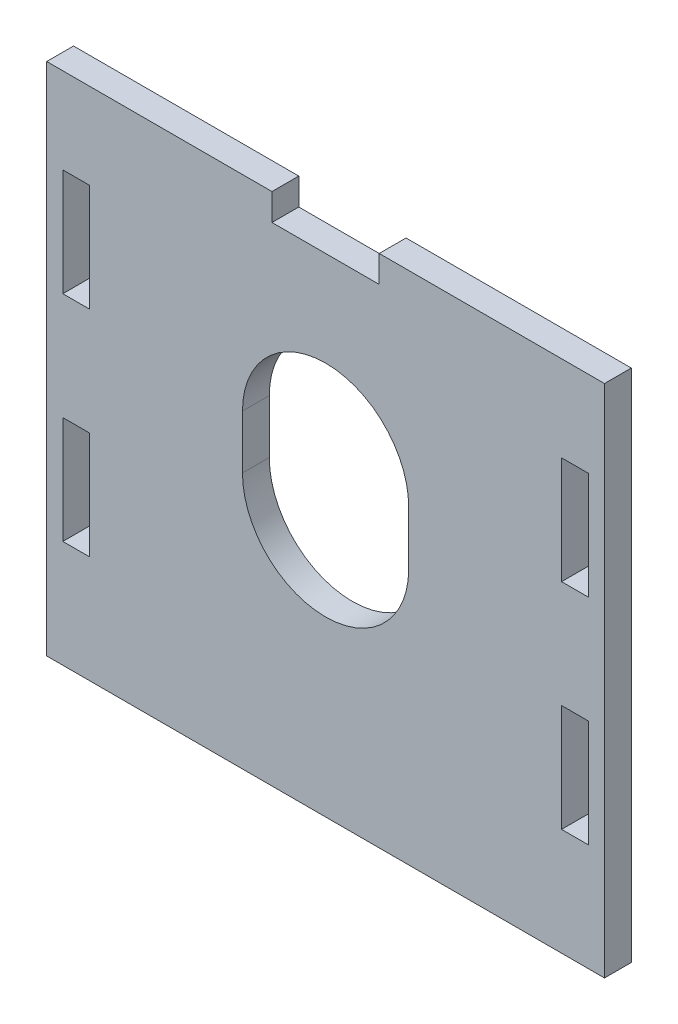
from build123d import *

# Parameters (mm, degrees)
SKETCH_1_W          = 52
SKETCH_1_H          = 48
EXTRUDE_1_DEPTH     = 2.5
SKETCH_2_W          = 2.5
SKETCH_2_H          = 10
CUT_EXTRUDE_1_DEPTH = 2.5
CUT_EXTRUDE_2_DEPTH = 2.5
SKETCH_4_W          = 10
SKETCH_4_H          = 2.5
CUT_EXTRUDE_3_DEPTH = 2.5


with BuildPart() as part:
    # Sketch 1 → Extrude 1 (new body)
    with BuildSketch(Plane.XY):
        with Locations((0, 24)):
            Rectangle(SKETCH_1_W, SKETCH_1_H)
    extrude(amount=EXTRUDE_1_DEPTH)

    # Sketch 2 → Cut-Extrude 1 (cut)
    with BuildSketch(Plane.XY.offset(2.5)):
        with Locations((23.25, 35)):
            Rectangle(SKETCH_2_W, SKETCH_2_H)
        with Locations((23.25, 15)):
            Rectangle(SKETCH_2_W, SKETCH_2_H)
        with Locations((-23.25, 15)):
            Rectangle(SKETCH_2_W, SKETCH_2_H)
        with Locations((-23.25, 35)):
            Rectangle(SKETCH_2_W, SKETCH_2_H)
    extrude(amount=-CUT_EXTRUDE_1_DEPTH, mode=Mode.SUBTRACT)

    # Sketch 3 → Cut-Extrude 2 (cut)
    with BuildSketch(Plane.XY.offset(2.5)):
        with BuildLine():
            Line((7.75, 28.9), (7.75, 23.9))
            ThreePointArc((7.75, 23.9), (0, 16.15), (-7.75, 23.9))
            Line((-7.75, 23.9), (-7.75, 28.9))
            ThreePointArc((-7.75, 28.9), (0, 36.65), (7.75, 28.9))
        make_face()
    extrude(amount=-CUT_EXTRUDE_2_DEPTH, mode=Mode.SUBTRACT)

    # Sketch 4 → Cut-Extrude 3 (cut)
    with BuildSketch(Plane.XY.offset(2.5)):
        with Locations((0, 46.75)):
            Rectangle(SKETCH_4_W, SKETCH_4_H)
    extrude(amount=-CUT_EXTRUDE_3_DEPTH, mode=Mode.SUBTRACT)


solid = part.part
